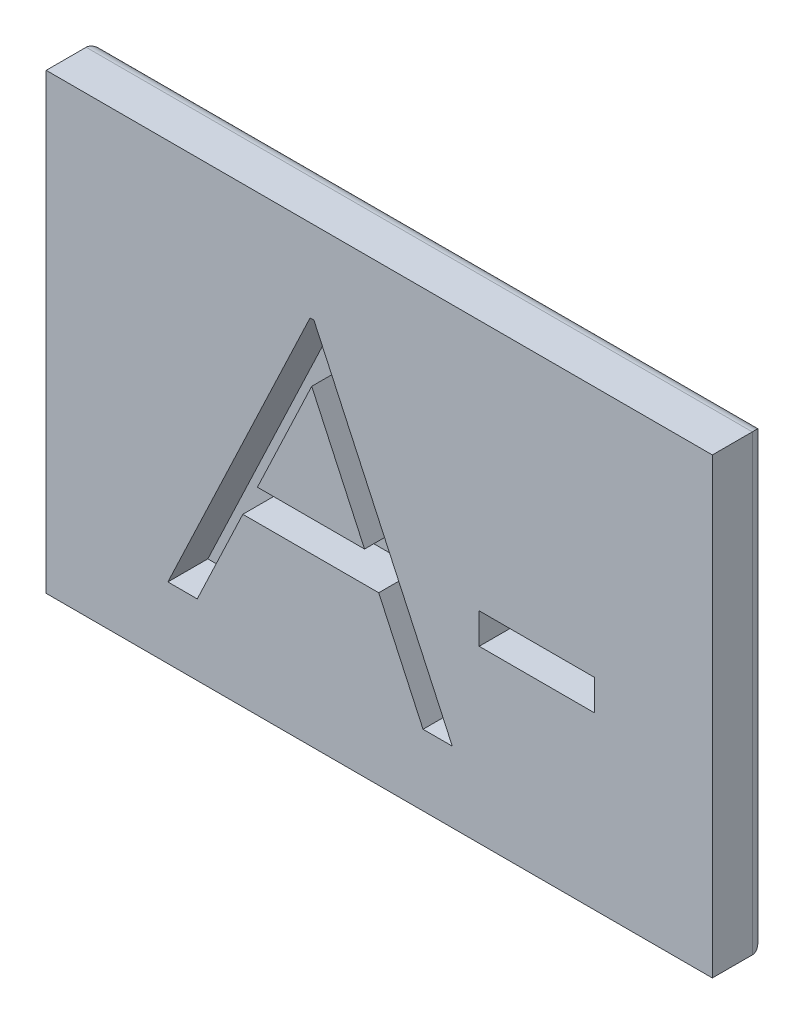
from build123d import *

# Parameters (mm, degrees)
SKETCH1_W           = 31.75
SKETCH1_H           = 21.59
BOSS_EXTRUDE1_DEPTH = 2.54
FILLET1_R           = 0.635
SKETCH2_W           = 5.495192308
SKETCH2_H           = 1.465384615
CUT_EXTRUDE1_DEPTH  = 1.905


with BuildPart() as part:
    # Sketch1 → Boss-Extrude1 (new body)
    with BuildSketch(Plane.XY):
        Rectangle(SKETCH1_W, SKETCH1_H)
    extrude(amount=BOSS_EXTRUDE1_DEPTH)

    # Fillet1
    fillet1_edges = [part.edges().sort_by_distance(p)[0] for p in [
        (0, -10.795, 0),
        (-15.875, 0, 0),
        (0, 10.795, 0),
        (15.875, 0, 0),
    ]]
    fillet(fillet1_edges, radius=FILLET1_R)

    # Sketch2 → Cut-Extrude1 (cut)
    # profile 1 of 2: a face of its own
    with BuildSketch(Plane.XY.offset(2.54)):
        Polygon((-3.113942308, 6.864769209), (3.480288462, -7.422730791), (2.086455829, -7.422730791), (-0.025758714, -2.843403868), (-6.502644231, -2.843403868), (-8.67496244, -7.422730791), (-10.074519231, -7.422730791), (-3.297115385, 6.864769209), align=None)
        Polygon((-3.219839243, 4.079966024), (-5.807158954, -1.378019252), (-0.701209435, -1.378019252), align=None, mode=Mode.SUBTRACT)
    # profile 2 of 2: a face of its own
    with BuildSketch(Plane.XY.offset(2.54)):
        with Locations((7.510096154, -1.927538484)):
            Rectangle(SKETCH2_W, SKETCH2_H)
    extrude(amount=-CUT_EXTRUDE1_DEPTH, mode=Mode.SUBTRACT)


solid = part.part
